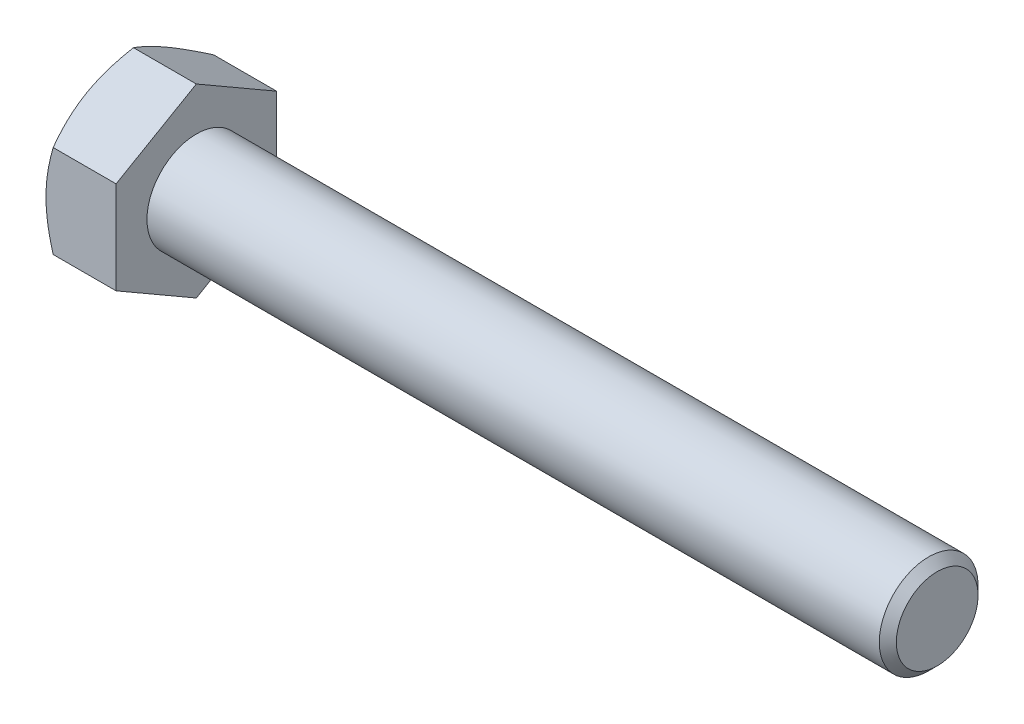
ISO-10303-21;
HEADER;
FILE_DESCRIPTION(('STEP AP214'),'2;1');
FILE_NAME('part.step','',(''),(''),'','','');
FILE_SCHEMA(('AUTOMOTIVE_DESIGN { 1 0 10303 214 1 1 1 1 }'));
ENDSEC;
DATA;
#1=APPLICATION_CONTEXT('core data for automotive mechanical design processes');
#2=APPLICATION_PROTOCOL_DEFINITION('international standard','automotive_design',2000,#1);
#3=PRODUCT_CONTEXT('',#1,'mechanical');
#4=PRODUCT('Part','Part','',(#3));
#5=PRODUCT_RELATED_PRODUCT_CATEGORY('part','',(#4));
#6=PRODUCT_DEFINITION_FORMATION('','',#4);
#7=PRODUCT_DEFINITION_CONTEXT('part definition',#1,'design');
#8=PRODUCT_DEFINITION('design','',#6,#7);
#9=PRODUCT_DEFINITION_SHAPE('','',#8);
#10=(LENGTH_UNIT() NAMED_UNIT(*) SI_UNIT(.MILLI.,.METRE.));
#11=(NAMED_UNIT(*) PLANE_ANGLE_UNIT() SI_UNIT($,.RADIAN.));
#12=(NAMED_UNIT(*) SI_UNIT($,.STERADIAN.) SOLID_ANGLE_UNIT());
#13=UNCERTAINTY_MEASURE_WITH_UNIT(LENGTH_MEASURE(1.E-05),#10,'distance_accuracy_value','');
#14=(GEOMETRIC_REPRESENTATION_CONTEXT(3) GLOBAL_UNCERTAINTY_ASSIGNED_CONTEXT((#13)) GLOBAL_UNIT_ASSIGNED_CONTEXT((#10,
#11,#12)) REPRESENTATION_CONTEXT('',''));
#15=CARTESIAN_POINT('',(0.,0.,0.));
#16=DIRECTION('',(0.,0.,1.));
#17=DIRECTION('',(1.,0.,0.));
#18=AXIS2_PLACEMENT_3D('',#15,#16,#17);
#19=CARTESIAN_POINT('',(5.675,3.75277674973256,-6.5));
#20=DIRECTION('',(0.,-0.866025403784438,0.500000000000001));
#21=DIRECTION('',(0.,-0.500000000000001,-0.866025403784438));
#22=AXIS2_PLACEMENT_3D('',#19,#20,#21);
#23=PLANE('',#22);
#24=CARTESIAN_POINT('',(0.580623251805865,7.50566896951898,0.0002));
#25=CARTESIAN_POINT('',(0.533004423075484,7.4231786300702,-0.14267745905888));
#26=CARTESIAN_POINT('',(0.487546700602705,7.34038072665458,-0.286087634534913));
#27=CARTESIAN_POINT('',(0.401548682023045,7.17411251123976,-0.574072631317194));
#28=CARTESIAN_POINT('',(0.361010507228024,7.09064192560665,-0.718647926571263));
#29=CARTESIAN_POINT('',(0.247571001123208,6.83889369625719,-1.15468865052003));
#30=CARTESIAN_POINT('',(0.183047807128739,6.66962231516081,-1.44787528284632));
#31=CARTESIAN_POINT('',(0.107386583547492,6.41631077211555,-1.88662374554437));
#32=CARTESIAN_POINT('',(0.0858328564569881,6.33302748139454,-2.03087463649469));
#33=CARTESIAN_POINT('',(0.0496903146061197,6.16608458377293,-2.32002821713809));
#34=CARTESIAN_POINT('',(0.0351008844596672,6.08242501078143,-2.46493084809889));
#35=CARTESIAN_POINT('',(0.0132587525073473,5.91496056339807,-2.75498777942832));
#36=CARTESIAN_POINT('',(0.00599772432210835,5.8311559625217,-2.90014160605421));
#37=CARTESIAN_POINT('',(-0.00103969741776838,5.66347396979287,-3.19057533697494));
#38=CARTESIAN_POINT('',(-0.000816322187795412,5.5795965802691,-3.33585523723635));
#39=CARTESIAN_POINT('',(0.0100834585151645,5.34979921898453,-3.73387594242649));
#40=CARTESIAN_POINT('',(0.0283818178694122,5.20395446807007,-3.98648646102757));
#41=CARTESIAN_POINT('',(0.0864063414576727,4.91323365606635,-4.49002967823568));
#42=CARTESIAN_POINT('',(0.126152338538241,4.76835861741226,-4.74096060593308));
#43=CARTESIAN_POINT('',(0.225505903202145,4.47705272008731,-5.24551722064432));
#44=CARTESIAN_POINT('',(0.285534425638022,4.33065861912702,-5.49907924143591));
#45=CARTESIAN_POINT('',(0.421774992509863,4.04005357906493,-6.00242193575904));
#46=CARTESIAN_POINT('',(0.497955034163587,3.89583891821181,-6.25220905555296));
#47=CARTESIAN_POINT('',(0.58062325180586,3.75266127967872,-6.5002));
#48=B_SPLINE_CURVE_WITH_KNOTS('',3,(#24,#25,#26,#27,#28,#29,#30,#31,#32,#33,#34,#35,#36,#37,#38,
#39,#40,#41,#42,#43,#44,#45,#46,#47),.UNSPECIFIED.,.F.,.F.,(4,2,2,2,2,2,2,2,2,2,2,4),(0.,
0.515105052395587,1.03043143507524,2.06322554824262,2.56697389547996,3.07067772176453,
3.57380860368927,4.0769239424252,4.9527935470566,5.82947446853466,6.72559912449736,
7.61996451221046),.UNSPECIFIED.);
#49=CARTESIAN_POINT('',(0.580556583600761,7.50555349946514,0.));
#50=VERTEX_POINT('',#49);
#51=CARTESIAN_POINT('',(0.,5.62916512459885,-3.25000000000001));
#52=VERTEX_POINT('',#51);
#53=EDGE_CURVE('E48',#50,#52,#48,.T.);
#54=ORIENTED_EDGE('',*,*,#53,.F.);
#55=DIRECTION('',(-1.,0.,0.));
#56=VECTOR('',#55,1.);
#57=CARTESIAN_POINT('',(5.675,7.50555349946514,0.));
#58=LINE('',#57,#56);
#59=CARTESIAN_POINT('',(5.675,7.50555349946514,0.));
#60=VERTEX_POINT('',#59);
#61=EDGE_CURVE('E144',#60,#50,#58,.T.);
#62=ORIENTED_EDGE('',*,*,#61,.F.);
#63=DIRECTION('',(0.,0.500000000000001,0.866025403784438));
#64=VECTOR('',#63,1.);
#65=CARTESIAN_POINT('',(5.675,3.75277674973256,-6.5));
#66=LINE('',#65,#64);
#67=CARTESIAN_POINT('',(5.675,3.75277674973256,-6.5));
#68=VERTEX_POINT('',#67);
#69=EDGE_CURVE('E229',#68,#60,#66,.T.);
#70=ORIENTED_EDGE('',*,*,#69,.F.);
#71=DIRECTION('',(-1.,0.,0.));
#72=VECTOR('',#71,1.);
#73=CARTESIAN_POINT('',(5.675,3.75277674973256,-6.5));
#74=LINE('',#73,#72);
#75=CARTESIAN_POINT('',(0.580556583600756,3.75277674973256,-6.5));
#76=VERTEX_POINT('',#75);
#77=EDGE_CURVE('E132',#68,#76,#74,.T.);
#78=ORIENTED_EDGE('',*,*,#77,.T.);
#79=EDGE_CURVE('E126',#52,#76,#48,.T.);
#80=ORIENTED_EDGE('',*,*,#79,.F.);
#81=EDGE_LOOP('',(#54,#62,#70,#78,#80));
#82=FACE_BOUND('',#81,.T.);
#83=ADVANCED_FACE('F32',(#82),#23,.F.);
#84=CARTESIAN_POINT('',(5.675,7.50555349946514,0.));
#85=DIRECTION('',(0.,-0.866025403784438,-0.500000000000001));
#86=DIRECTION('',(0.,0.500000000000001,-0.866025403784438));
#87=AXIS2_PLACEMENT_3D('',#84,#85,#86);
#88=PLANE('',#87);
#89=CARTESIAN_POINT('',(0.580623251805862,3.75266127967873,6.5002));
#90=CARTESIAN_POINT('',(0.53300442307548,3.8351516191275,6.35732254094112));
#91=CARTESIAN_POINT('',(0.487546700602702,3.91794952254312,6.21391236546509));
#92=CARTESIAN_POINT('',(0.401548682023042,4.08421773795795,5.9259273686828));
#93=CARTESIAN_POINT('',(0.361010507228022,4.16768832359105,5.78135207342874));
#94=CARTESIAN_POINT('',(0.247571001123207,4.41943655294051,5.34531134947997));
#95=CARTESIAN_POINT('',(0.183047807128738,4.58870793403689,5.05212471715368));
#96=CARTESIAN_POINT('',(0.107386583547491,4.84201947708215,4.61337625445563));
#97=CARTESIAN_POINT('',(0.0858328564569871,4.92530276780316,4.46912536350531));
#98=CARTESIAN_POINT('',(0.0496903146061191,5.09224566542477,4.17997178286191));
#99=CARTESIAN_POINT('',(0.0351008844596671,5.17590523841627,4.03506915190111));
#100=CARTESIAN_POINT('',(0.0132587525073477,5.34336968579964,3.74501222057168));
#101=CARTESIAN_POINT('',(0.00599772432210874,5.427174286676,3.59985839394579));
#102=CARTESIAN_POINT('',(-0.00103969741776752,5.59485627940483,3.30942466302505));
#103=CARTESIAN_POINT('',(-0.000816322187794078,5.6787336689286,3.16414476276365));
#104=CARTESIAN_POINT('',(0.0100834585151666,5.90853103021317,2.76612405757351));
#105=CARTESIAN_POINT('',(0.0283818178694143,6.05437578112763,2.51351353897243));
#106=CARTESIAN_POINT('',(0.0864063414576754,6.34509659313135,2.00997032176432));
#107=CARTESIAN_POINT('',(0.126152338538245,6.48997163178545,1.75903939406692));
#108=CARTESIAN_POINT('',(0.225505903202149,6.78127752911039,1.25448277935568));
#109=CARTESIAN_POINT('',(0.285534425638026,6.92767163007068,1.00092075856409));
#110=CARTESIAN_POINT('',(0.421774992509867,7.21827667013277,0.497578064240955));
#111=CARTESIAN_POINT('',(0.497955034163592,7.36249133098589,0.247790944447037));
#112=CARTESIAN_POINT('',(0.580623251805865,7.50566896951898,-0.000200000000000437));
#113=B_SPLINE_CURVE_WITH_KNOTS('',3,(#89,#90,#91,#92,#93,#94,#95,#96,#97,#98,#99,#100,#101,#102,
#103,#104,#105,#106,#107,#108,#109,#110,#111,#112),.UNSPECIFIED.,.F.,.F.,(4,2,2,2,2,2,2,2,2,2,2,
4),(0.,0.515105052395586,1.03043143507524,2.06322554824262,2.56697389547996,3.07067772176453,
3.57380860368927,4.07692394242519,4.9527935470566,5.82947446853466,6.72559912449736,
7.61996451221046),.UNSPECIFIED.);
#114=CARTESIAN_POINT('',(0.580556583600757,3.75277674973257,6.5));
#115=VERTEX_POINT('',#114);
#116=CARTESIAN_POINT('',(0.,5.62916512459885,3.25));
#117=VERTEX_POINT('',#116);
#118=EDGE_CURVE('E55',#115,#117,#113,.T.);
#119=ORIENTED_EDGE('',*,*,#118,.F.);
#120=DIRECTION('',(-1.,0.,0.));
#121=VECTOR('',#120,1.);
#122=CARTESIAN_POINT('',(5.675,3.75277674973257,6.5));
#123=LINE('',#122,#121);
#124=CARTESIAN_POINT('',(5.675,3.75277674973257,6.5));
#125=VERTEX_POINT('',#124);
#126=EDGE_CURVE('E142',#125,#115,#123,.T.);
#127=ORIENTED_EDGE('',*,*,#126,.F.);
#128=DIRECTION('',(0.,-0.500000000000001,0.866025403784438));
#129=VECTOR('',#128,1.);
#130=CARTESIAN_POINT('',(5.675,7.50555349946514,0.));
#131=LINE('',#130,#129);
#132=EDGE_CURVE('E227',#60,#125,#131,.T.);
#133=ORIENTED_EDGE('',*,*,#132,.F.);
#134=ORIENTED_EDGE('',*,*,#61,.T.);
#135=EDGE_CURVE('E159',#117,#50,#113,.T.);
#136=ORIENTED_EDGE('',*,*,#135,.F.);
#137=EDGE_LOOP('',(#119,#127,#133,#134,#136));
#138=FACE_BOUND('',#137,.T.);
#139=ADVANCED_FACE('F165',(#138),#88,.F.);
#140=CARTESIAN_POINT('',(5.675,3.75277674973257,6.5));
#141=DIRECTION('',(0.,0.,-1.));
#142=DIRECTION('',(0.,1.,0.));
#143=AXIS2_PLACEMENT_3D('',#140,#141,#142);
#144=PLANE('',#143);
#145=CARTESIAN_POINT('',(3.18835311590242,-10.1137456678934,6.5));
#146=CARTESIAN_POINT('',(3.05034774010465,-9.82952666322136,6.5));
#147=CARTESIAN_POINT('',(2.91365616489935,-9.54465869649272,6.5));
#148=CARTESIAN_POINT('',(2.64363899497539,-8.9732797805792,6.5));
#149=CARTESIAN_POINT('',(2.51031392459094,-8.6867685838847,6.5));
#150=CARTESIAN_POINT('',(2.24710473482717,-8.11029837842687,6.5));
#151=CARTESIAN_POINT('',(2.11724300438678,-7.8203291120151,6.5));
#152=CARTESIAN_POINT('',(1.86279082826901,-7.23809541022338,6.5));
#153=CARTESIAN_POINT('',(1.73820013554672,-6.94583108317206,6.5));
#154=CARTESIAN_POINT('',(1.4917668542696,-6.34906440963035,6.5));
#155=CARTESIAN_POINT('',(1.37014257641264,-6.04447142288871,6.5));
#156=CARTESIAN_POINT('',(1.13601865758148,-5.43173420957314,6.5));
#157=CARTESIAN_POINT('',(1.02352003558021,-5.12358959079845,6.5));
#158=CARTESIAN_POINT('',(0.810575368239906,-4.50382569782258,6.5));
#159=CARTESIAN_POINT('',(0.710105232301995,-4.19221478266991,6.5));
#160=CARTESIAN_POINT('',(0.524420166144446,-3.56452019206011,6.5));
#161=CARTESIAN_POINT('',(0.439200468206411,-3.24843794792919,6.5));
#162=CARTESIAN_POINT('',(0.288524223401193,-2.61335465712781,6.5));
#163=CARTESIAN_POINT('',(0.222961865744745,-2.29437912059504,6.5));
#164=CARTESIAN_POINT('',(0.115312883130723,-1.65238219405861,6.5));
#165=CARTESIAN_POINT('',(0.0732239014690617,-1.32936121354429,6.5));
#166=CARTESIAN_POINT('',(0.0304887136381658,-0.845231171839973,6.5));
#167=CARTESIAN_POINT('',(0.0196493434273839,-0.684982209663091,6.5));
#168=CARTESIAN_POINT('',(0.00475298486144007,-0.36416234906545,6.5));
#169=CARTESIAN_POINT('',(0.000695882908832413,-0.20359145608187,6.5));
#170=CARTESIAN_POINT('',(-0.00053159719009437,0.117577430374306,6.5));
#171=CARTESIAN_POINT('',(0.00229809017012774,0.278175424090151,6.5));
#172=CARTESIAN_POINT('',(0.014772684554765,0.599108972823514,6.5));
#173=CARTESIAN_POINT('',(0.0244179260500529,0.759444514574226,6.5));
#174=CARTESIAN_POINT('',(0.0554961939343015,1.14369946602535,6.5));
#175=CARTESIAN_POINT('',(0.0801030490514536,1.36736763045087,6.5));
#176=CARTESIAN_POINT('',(0.14124653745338,1.81305591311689,6.5));
#177=CARTESIAN_POINT('',(0.177784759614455,2.03507580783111,6.5));
#178=CARTESIAN_POINT('',(0.303360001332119,2.69839633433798,6.5));
#179=CARTESIAN_POINT('',(0.4083358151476,3.1367201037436,6.5));
#180=CARTESIAN_POINT('',(0.590564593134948,3.79232112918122,6.5));
#181=CARTESIAN_POINT('',(0.6563131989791,4.01299150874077,6.5));
#182=CARTESIAN_POINT('',(0.794681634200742,4.45218859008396,6.5));
#183=CARTESIAN_POINT('',(0.867301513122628,4.67071527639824,6.5));
#184=CARTESIAN_POINT('',(1.01824353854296,5.10569490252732,6.5));
#185=CARTESIAN_POINT('',(1.0965638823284,5.32214847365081,6.5));
#186=CARTESIAN_POINT('',(1.25798086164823,5.75325725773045,6.5));
#187=CARTESIAN_POINT('',(1.34107741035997,5.96791250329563,6.5));
#188=CARTESIAN_POINT('',(1.56029019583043,6.51888445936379,6.5));
#189=CARTESIAN_POINT('',(1.69936356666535,6.85402316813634,6.5));
#190=CARTESIAN_POINT('',(1.98501958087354,7.521095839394,6.5));
#191=CARTESIAN_POINT('',(2.13160288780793,7.85302951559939,6.5));
#192=CARTESIAN_POINT('',(2.43059748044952,8.51437865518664,6.5));
#193=CARTESIAN_POINT('',(2.5830105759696,8.843793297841,6.5));
#194=CARTESIAN_POINT('',(2.89234869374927,9.50047798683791,6.5));
#195=CARTESIAN_POINT('',(3.04927357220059,9.82774810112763,6.5));
#196=CARTESIAN_POINT('',(3.36692013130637,10.4809971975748,6.5));
#197=CARTESIAN_POINT('',(3.52764676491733,10.8069737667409,6.5));
#198=CARTESIAN_POINT('',(3.85198555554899,11.4574882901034,6.5));
#199=CARTESIAN_POINT('',(4.01559773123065,11.7820262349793,6.5));
#200=CARTESIAN_POINT('',(4.50986185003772,12.7537468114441,6.5));
#201=CARTESIAN_POINT('',(4.8439999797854,13.3991555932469,6.5));
#202=CARTESIAN_POINT('',(5.48575990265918,14.6239779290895,6.5));
#203=CARTESIAN_POINT('',(5.79279643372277,15.2036995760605,6.5));
#204=CARTESIAN_POINT('',(6.41069188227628,16.3611382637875,6.5));
#205=CARTESIAN_POINT('',(6.72155099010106,16.9388552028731,6.5));
#206=CARTESIAN_POINT('',(7.34519775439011,18.0910273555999,6.5));
#207=CARTESIAN_POINT('',(7.65797694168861,18.6654871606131,6.5));
#208=CARTESIAN_POINT('',(8.28574397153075,19.8131486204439,6.5));
#209=CARTESIAN_POINT('',(8.60073166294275,20.3863503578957,6.5));
#210=CARTESIAN_POINT('',(8.91652967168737,20.9591024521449,6.5));
#211=B_SPLINE_CURVE_WITH_KNOTS('',3,(#145,#146,#147,#148,#149,#150,#151,#152,#153,#154,#155,
#156,#157,#158,#159,#160,#161,#162,#163,#164,#165,#166,#167,#168,#169,#170,#171,#172,#173,#174,
#175,#176,#177,#178,#179,#180,#181,#182,#183,#184,#185,#186,#187,#188,#189,#190,#191,#192,#193,
#194,#195,#196,#197,#198,#199,#200,#201,#202,#203,#204,#205,#206,#207,#208,#209,#210),
.UNSPECIFIED.,.F.,.F.,(4,2,2,2,2,2,2,2,2,2,2,2,2,2,2,2,2,2,2,2,2,2,2,2,2,2,2,2,2,2,2,2,4),(0.,
0.94786866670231,1.89588406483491,2.84900320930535,3.80207763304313,4.78589774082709,
5.76982755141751,6.75175256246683,7.73337005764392,8.7096047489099,9.68574140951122,
10.1674651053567,10.6491807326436,11.1309009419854,11.6126447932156,12.287317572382,
12.9620802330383,14.312318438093,15.0030310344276,15.6937486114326,16.3842486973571,
17.0747362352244,18.1631508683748,19.2516618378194,20.3405135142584,21.429330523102,
22.5196540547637,23.6099846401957,25.7902468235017,27.7582608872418,29.7263733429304,
31.6886408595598,33.6507753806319),.UNSPECIFIED.);
#212=CARTESIAN_POINT('',(0.580556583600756,-3.75277674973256,6.5));
#213=VERTEX_POINT('',#212);
#214=CARTESIAN_POINT('',(0.,0.,6.5));
#215=VERTEX_POINT('',#214);
#216=EDGE_CURVE('E239',#213,#215,#211,.T.);
#217=ORIENTED_EDGE('',*,*,#216,.F.);
#218=DIRECTION('',(-1.,0.,0.));
#219=VECTOR('',#218,1.);
#220=CARTESIAN_POINT('',(5.675,-3.75277674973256,6.5));
#221=LINE('',#220,#219);
#222=CARTESIAN_POINT('',(5.675,-3.75277674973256,6.5));
#223=VERTEX_POINT('',#222);
#224=EDGE_CURVE('E134',#223,#213,#221,.T.);
#225=ORIENTED_EDGE('',*,*,#224,.F.);
#226=DIRECTION('',(0.,-1.,0.));
#227=VECTOR('',#226,1.);
#228=CARTESIAN_POINT('',(5.675,3.75277674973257,6.5));
#229=LINE('',#228,#227);
#230=EDGE_CURVE('E223',#125,#223,#229,.T.);
#231=ORIENTED_EDGE('',*,*,#230,.F.);
#232=ORIENTED_EDGE('',*,*,#126,.T.);
#233=EDGE_CURVE('E181',#215,#115,#211,.T.);
#234=ORIENTED_EDGE('',*,*,#233,.F.);
#235=EDGE_LOOP('',(#217,#225,#231,#232,#234));
#236=FACE_BOUND('',#235,.T.);
#237=ADVANCED_FACE('F245',(#236),#144,.F.);
#238=CARTESIAN_POINT('',(5.675,-7.50555349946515,0.));
#239=DIRECTION('',(0.,0.866025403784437,-0.500000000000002));
#240=DIRECTION('',(0.,0.500000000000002,0.866025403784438));
#241=AXIS2_PLACEMENT_3D('',#238,#239,#240);
#242=PLANE('',#241);
#243=CARTESIAN_POINT('',(0.580623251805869,-7.50566896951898,-0.000200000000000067));
#244=CARTESIAN_POINT('',(0.533004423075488,-7.42317863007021,0.14267745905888));
#245=CARTESIAN_POINT('',(0.487546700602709,-7.34038072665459,0.286087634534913));
#246=CARTESIAN_POINT('',(0.401548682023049,-7.17411251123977,0.574072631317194));
#247=CARTESIAN_POINT('',(0.361010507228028,-7.09064192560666,0.718647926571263));
#248=CARTESIAN_POINT('',(0.247571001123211,-6.8388936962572,1.15468865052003));
#249=CARTESIAN_POINT('',(0.183047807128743,-6.66962231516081,1.44787528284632));
#250=CARTESIAN_POINT('',(0.107386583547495,-6.41631077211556,1.88662374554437));
#251=CARTESIAN_POINT('',(0.0858328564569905,-6.33302748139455,2.03087463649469));
#252=CARTESIAN_POINT('',(0.049690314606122,-6.16608458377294,2.32002821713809));
#253=CARTESIAN_POINT('',(0.0351008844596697,-6.08242501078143,2.46493084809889));
#254=CARTESIAN_POINT('',(0.0132587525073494,-5.91496056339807,2.75498777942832));
#255=CARTESIAN_POINT('',(0.00599772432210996,-5.83115596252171,2.90014160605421));
#256=CARTESIAN_POINT('',(-0.00103969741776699,-5.66347396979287,3.19057533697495));
#257=CARTESIAN_POINT('',(-0.000816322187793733,-5.5795965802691,3.33585523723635));
#258=CARTESIAN_POINT('',(0.0100834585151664,-5.34979921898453,3.73387594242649));
#259=CARTESIAN_POINT('',(0.0283818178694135,-5.20395446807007,3.98648646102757));
#260=CARTESIAN_POINT('',(0.0864063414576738,-4.91323365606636,4.49002967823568));
#261=CARTESIAN_POINT('',(0.126152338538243,-4.76835861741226,4.74096060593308));
#262=CARTESIAN_POINT('',(0.225505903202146,-4.47705272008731,5.24551722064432));
#263=CARTESIAN_POINT('',(0.285534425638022,-4.33065861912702,5.49907924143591));
#264=CARTESIAN_POINT('',(0.421774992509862,-4.04005357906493,6.00242193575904));
#265=CARTESIAN_POINT('',(0.497955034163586,-3.89583891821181,6.25220905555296));
#266=CARTESIAN_POINT('',(0.580623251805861,-3.75266127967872,6.5002));
#267=B_SPLINE_CURVE_WITH_KNOTS('',3,(#243,#244,#245,#246,#247,#248,#249,#250,#251,#252,#253,
#254,#255,#256,#257,#258,#259,#260,#261,#262,#263,#264,#265,#266),.UNSPECIFIED.,.F.,.F.,(4,2,2,
2,2,2,2,2,2,2,2,4),(0.,0.515105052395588,1.03043143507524,2.06322554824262,2.56697389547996,
3.07067772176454,3.57380860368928,4.0769239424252,4.9527935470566,5.82947446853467,
6.72559912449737,7.61996451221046),.UNSPECIFIED.);
#268=CARTESIAN_POINT('',(0.580556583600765,-7.50555349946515,0.));
#269=VERTEX_POINT('',#268);
#270=CARTESIAN_POINT('',(0.,-5.62916512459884,3.25000000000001));
#271=VERTEX_POINT('',#270);
#272=EDGE_CURVE('E167',#269,#271,#267,.T.);
#273=ORIENTED_EDGE('',*,*,#272,.F.);
#274=DIRECTION('',(-1.,0.,0.));
#275=VECTOR('',#274,1.);
#276=CARTESIAN_POINT('',(5.675,-7.50555349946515,0.));
#277=LINE('',#276,#275);
#278=CARTESIAN_POINT('',(5.675,-7.50555349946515,0.));
#279=VERTEX_POINT('',#278);
#280=EDGE_CURVE('E131',#279,#269,#277,.T.);
#281=ORIENTED_EDGE('',*,*,#280,.F.);
#282=DIRECTION('',(0.,-0.500000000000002,-0.866025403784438));
#283=VECTOR('',#282,1.);
#284=CARTESIAN_POINT('',(5.675,-7.50555349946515,0.));
#285=LINE('',#284,#283);
#286=EDGE_CURVE('E221',#223,#279,#285,.T.);
#287=ORIENTED_EDGE('',*,*,#286,.F.);
#288=ORIENTED_EDGE('',*,*,#224,.T.);
#289=EDGE_CURVE('E169',#271,#213,#267,.T.);
#290=ORIENTED_EDGE('',*,*,#289,.F.);
#291=EDGE_LOOP('',(#273,#281,#287,#288,#290));
#292=FACE_BOUND('',#291,.T.);
#293=ADVANCED_FACE('F217',(#292),#242,.F.);
#294=CARTESIAN_POINT('',(5.675,-3.75277674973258,-6.5));
#295=DIRECTION('',(0.,0.866025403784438,0.5));
#296=DIRECTION('',(0.,-0.5,0.866025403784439));
#297=AXIS2_PLACEMENT_3D('',#294,#295,#296);
#298=PLANE('',#297);
#299=CARTESIAN_POINT('',(0.580623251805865,-3.75266127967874,-6.5002));
#300=CARTESIAN_POINT('',(0.533004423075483,-3.83515161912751,-6.35732254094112));
#301=CARTESIAN_POINT('',(0.487546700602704,-3.91794952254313,-6.21391236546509));
#302=CARTESIAN_POINT('',(0.401548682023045,-4.08421773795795,-5.9259273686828));
#303=CARTESIAN_POINT('',(0.361010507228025,-4.16768832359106,-5.78135207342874));
#304=CARTESIAN_POINT('',(0.24757100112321,-4.41943655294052,-5.34531134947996));
#305=CARTESIAN_POINT('',(0.183047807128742,-4.5887079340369,-5.05212471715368));
#306=CARTESIAN_POINT('',(0.107386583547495,-4.84201947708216,-4.61337625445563));
#307=CARTESIAN_POINT('',(0.085832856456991,-4.92530276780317,-4.46912536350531));
#308=CARTESIAN_POINT('',(0.0496903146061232,-5.09224566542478,-4.17997178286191));
#309=CARTESIAN_POINT('',(0.0351008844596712,-5.17590523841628,-4.03506915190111));
#310=CARTESIAN_POINT('',(0.0132587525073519,-5.34336968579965,-3.74501222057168));
#311=CARTESIAN_POINT('',(0.00599772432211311,-5.42717428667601,-3.59985839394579));
#312=CARTESIAN_POINT('',(-0.00103969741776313,-5.59485627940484,-3.30942466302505));
#313=CARTESIAN_POINT('',(-0.000816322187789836,-5.67873366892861,-3.16414476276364));
#314=CARTESIAN_POINT('',(0.0100834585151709,-5.90853103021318,-2.76612405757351));
#315=CARTESIAN_POINT('',(0.028381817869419,-6.05437578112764,-2.51351353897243));
#316=CARTESIAN_POINT('',(0.0864063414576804,-6.34509659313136,-2.00997032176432));
#317=CARTESIAN_POINT('',(0.12615233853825,-6.48997163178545,-1.75903939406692));
#318=CARTESIAN_POINT('',(0.225505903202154,-6.78127752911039,-1.25448277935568));
#319=CARTESIAN_POINT('',(0.28553442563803,-6.92767163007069,-1.00092075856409));
#320=CARTESIAN_POINT('',(0.421774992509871,-7.21827667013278,-0.497578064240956));
#321=CARTESIAN_POINT('',(0.497955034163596,-7.3624913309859,-0.247790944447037));
#322=CARTESIAN_POINT('',(0.580623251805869,-7.50566896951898,0.000199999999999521));
#323=B_SPLINE_CURVE_WITH_KNOTS('',3,(#299,#300,#301,#302,#303,#304,#305,#306,#307,#308,#309,
#310,#311,#312,#313,#314,#315,#316,#317,#318,#319,#320,#321,#322),.UNSPECIFIED.,.F.,.F.,(4,2,2,
2,2,2,2,2,2,2,2,4),(0.,0.515105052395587,1.03043143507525,2.06322554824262,2.56697389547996,
3.07067772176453,3.57380860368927,4.0769239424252,4.9527935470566,5.82947446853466,
6.72559912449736,7.61996451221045),.UNSPECIFIED.);
#324=CARTESIAN_POINT('',(0.580556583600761,-3.75277674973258,-6.5));
#325=VERTEX_POINT('',#324);
#326=CARTESIAN_POINT('',(0.,-5.62916512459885,-3.25));
#327=VERTEX_POINT('',#326);
#328=EDGE_CURVE('E108',#325,#327,#323,.T.);
#329=ORIENTED_EDGE('',*,*,#328,.F.);
#330=DIRECTION('',(-1.,0.,0.));
#331=VECTOR('',#330,1.);
#332=CARTESIAN_POINT('',(5.675,-3.75277674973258,-6.5));
#333=LINE('',#332,#331);
#334=CARTESIAN_POINT('',(5.675,-3.75277674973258,-6.5));
#335=VERTEX_POINT('',#334);
#336=EDGE_CURVE('E122',#335,#325,#333,.T.);
#337=ORIENTED_EDGE('',*,*,#336,.F.);
#338=DIRECTION('',(0.,0.5,-0.866025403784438));
#339=VECTOR('',#338,1.);
#340=CARTESIAN_POINT('',(5.675,-3.75277674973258,-6.5));
#341=LINE('',#340,#339);
#342=EDGE_CURVE('E219',#279,#335,#341,.T.);
#343=ORIENTED_EDGE('',*,*,#342,.F.);
#344=ORIENTED_EDGE('',*,*,#280,.T.);
#345=EDGE_CURVE('E125',#327,#269,#323,.T.);
#346=ORIENTED_EDGE('',*,*,#345,.F.);
#347=EDGE_LOOP('',(#329,#337,#343,#344,#346));
#348=FACE_BOUND('',#347,.T.);
#349=ADVANCED_FACE('F120',(#348),#298,.F.);
#350=CARTESIAN_POINT('',(5.675,3.75277674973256,-6.5));
#351=DIRECTION('',(0.,0.,1.));
#352=DIRECTION('',(0.,-1.,0.));
#353=AXIS2_PLACEMENT_3D('',#350,#351,#352);
#354=PLANE('',#353);
#355=CARTESIAN_POINT('',(3.18835311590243,-10.1137456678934,-6.5));
#356=CARTESIAN_POINT('',(3.05034774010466,-9.82952666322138,-6.5));
#357=CARTESIAN_POINT('',(2.91365616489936,-9.54465869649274,-6.5));
#358=CARTESIAN_POINT('',(2.64363899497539,-8.97327978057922,-6.5));
#359=CARTESIAN_POINT('',(2.51031392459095,-8.68676858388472,-6.5));
#360=CARTESIAN_POINT('',(2.24710473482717,-8.11029837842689,-6.5));
#361=CARTESIAN_POINT('',(2.11724300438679,-7.82032911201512,-6.5));
#362=CARTESIAN_POINT('',(1.86279082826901,-7.2380954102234,-6.5));
#363=CARTESIAN_POINT('',(1.73820013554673,-6.94583108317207,-6.5));
#364=CARTESIAN_POINT('',(1.4917668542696,-6.34906440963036,-6.5));
#365=CARTESIAN_POINT('',(1.37014257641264,-6.04447142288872,-6.5));
#366=CARTESIAN_POINT('',(1.13601865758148,-5.43173420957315,-6.5));
#367=CARTESIAN_POINT('',(1.02352003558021,-5.12358959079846,-6.5));
#368=CARTESIAN_POINT('',(0.810575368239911,-4.5038256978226,-6.5));
#369=CARTESIAN_POINT('',(0.710105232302,-4.19221478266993,-6.5));
#370=CARTESIAN_POINT('',(0.52442016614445,-3.56452019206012,-6.5));
#371=CARTESIAN_POINT('',(0.439200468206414,-3.24843794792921,-6.5));
#372=CARTESIAN_POINT('',(0.288524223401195,-2.61335465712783,-6.5));
#373=CARTESIAN_POINT('',(0.222961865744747,-2.29437912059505,-6.5));
#374=CARTESIAN_POINT('',(0.115312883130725,-1.65238219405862,-6.5));
#375=CARTESIAN_POINT('',(0.0732239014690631,-1.3293612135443,-6.5));
#376=CARTESIAN_POINT('',(0.0304887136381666,-0.845231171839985,-6.5));
#377=CARTESIAN_POINT('',(0.0196493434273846,-0.684982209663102,-6.5));
#378=CARTESIAN_POINT('',(0.00475298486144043,-0.36416234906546,-6.5));
#379=CARTESIAN_POINT('',(0.000695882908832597,-0.20359145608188,-6.5));
#380=CARTESIAN_POINT('',(-0.000531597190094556,0.117577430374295,-6.5));
#381=CARTESIAN_POINT('',(0.00229809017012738,0.278175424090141,-6.5));
#382=CARTESIAN_POINT('',(0.0147726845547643,0.599108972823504,-6.5));
#383=CARTESIAN_POINT('',(0.0244179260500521,0.759444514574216,-6.5));
#384=CARTESIAN_POINT('',(0.0554961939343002,1.14369946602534,-6.5));
#385=CARTESIAN_POINT('',(0.0801030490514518,1.36736763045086,-6.5));
#386=CARTESIAN_POINT('',(0.141246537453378,1.81305591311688,-6.5));
#387=CARTESIAN_POINT('',(0.177784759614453,2.03507580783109,-6.5));
#388=CARTESIAN_POINT('',(0.303360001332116,2.69839633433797,-6.5));
#389=CARTESIAN_POINT('',(0.408335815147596,3.13672010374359,-6.5));
#390=CARTESIAN_POINT('',(0.590564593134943,3.79232112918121,-6.5));
#391=CARTESIAN_POINT('',(0.656313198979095,4.01299150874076,-6.5));
#392=CARTESIAN_POINT('',(0.794681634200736,4.45218859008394,-6.5));
#393=CARTESIAN_POINT('',(0.867301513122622,4.67071527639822,-6.5));
#394=CARTESIAN_POINT('',(1.01824353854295,5.1056949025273,-6.5));
#395=CARTESIAN_POINT('',(1.09656388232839,5.3221484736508,-6.5));
#396=CARTESIAN_POINT('',(1.25798086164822,5.75325725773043,-6.5));
#397=CARTESIAN_POINT('',(1.34107741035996,5.96791250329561,-6.5));
#398=CARTESIAN_POINT('',(1.56029019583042,6.51888445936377,-6.5));
#399=CARTESIAN_POINT('',(1.69936356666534,6.85402316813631,-6.5));
#400=CARTESIAN_POINT('',(1.98501958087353,7.52109583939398,-6.5));
#401=CARTESIAN_POINT('',(2.13160288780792,7.85302951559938,-6.5));
#402=CARTESIAN_POINT('',(2.43059748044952,8.51437865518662,-6.5));
#403=CARTESIAN_POINT('',(2.58301057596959,8.84379329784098,-6.5));
#404=CARTESIAN_POINT('',(2.89234869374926,9.50047798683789,-6.5));
#405=CARTESIAN_POINT('',(3.04927357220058,9.82774810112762,-6.5));
#406=CARTESIAN_POINT('',(3.36692013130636,10.4809971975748,-6.5));
#407=CARTESIAN_POINT('',(3.52764676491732,10.8069737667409,-6.5));
#408=CARTESIAN_POINT('',(3.85198555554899,11.4574882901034,-6.5));
#409=CARTESIAN_POINT('',(4.01559773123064,11.7820262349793,-6.5));
#410=CARTESIAN_POINT('',(4.50986185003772,12.7537468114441,-6.5));
#411=CARTESIAN_POINT('',(4.84399997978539,13.3991555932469,-6.5));
#412=CARTESIAN_POINT('',(5.48575990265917,14.6239779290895,-6.5));
#413=CARTESIAN_POINT('',(5.79279643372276,15.2036995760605,-6.5));
#414=CARTESIAN_POINT('',(6.41069188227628,16.3611382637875,-6.5));
#415=CARTESIAN_POINT('',(6.72155099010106,16.9388552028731,-6.5));
#416=CARTESIAN_POINT('',(7.34519775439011,18.0910273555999,-6.5));
#417=CARTESIAN_POINT('',(7.65797694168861,18.6654871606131,-6.5));
#418=CARTESIAN_POINT('',(8.28574397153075,19.8131486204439,-6.5));
#419=CARTESIAN_POINT('',(8.60073166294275,20.3863503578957,-6.5));
#420=CARTESIAN_POINT('',(8.91652967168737,20.9591024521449,-6.5));
#421=B_SPLINE_CURVE_WITH_KNOTS('',3,(#355,#356,#357,#358,#359,#360,#361,#362,#363,#364,#365,
#366,#367,#368,#369,#370,#371,#372,#373,#374,#375,#376,#377,#378,#379,#380,#381,#382,#383,#384,
#385,#386,#387,#388,#389,#390,#391,#392,#393,#394,#395,#396,#397,#398,#399,#400,#401,#402,#403,
#404,#405,#406,#407,#408,#409,#410,#411,#412,#413,#414,#415,#416,#417,#418,#419,#420),
.UNSPECIFIED.,.F.,.F.,(4,2,2,2,2,2,2,2,2,2,2,2,2,2,2,2,2,2,2,2,2,2,2,2,2,2,2,2,2,2,2,2,4),(0.,
0.947868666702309,1.89588406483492,2.84900320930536,3.80207763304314,4.7858977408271,
5.76982755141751,6.75175256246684,7.73337005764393,8.7096047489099,9.68574140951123,
10.1674651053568,10.6491807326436,11.1309009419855,11.6126447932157,12.287317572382,
12.9620802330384,14.312318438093,15.0030310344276,15.6937486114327,16.3842486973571,
17.0747362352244,18.1631508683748,19.2516618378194,20.3405135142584,21.429330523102,
22.5196540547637,23.6099846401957,25.7902468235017,27.7582608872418,29.7263733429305,
31.6886408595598,33.6507753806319),.UNSPECIFIED.);
#422=CARTESIAN_POINT('',(0.,0.,-6.5));
#423=VERTEX_POINT('',#422);
#424=EDGE_CURVE('E114',#76,#423,#421,.F.);
#425=ORIENTED_EDGE('',*,*,#424,.F.);
#426=ORIENTED_EDGE('',*,*,#77,.F.);
#427=DIRECTION('',(0.,1.,0.));
#428=VECTOR('',#427,1.);
#429=CARTESIAN_POINT('',(5.675,3.75277674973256,-6.5));
#430=LINE('',#429,#428);
#431=EDGE_CURVE('E130',#335,#68,#430,.T.);
#432=ORIENTED_EDGE('',*,*,#431,.F.);
#433=ORIENTED_EDGE('',*,*,#336,.T.);
#434=EDGE_CURVE('E105',#423,#325,#421,.F.);
#435=ORIENTED_EDGE('',*,*,#434,.F.);
#436=EDGE_LOOP('',(#425,#426,#432,#433,#435));
#437=FACE_BOUND('',#436,.T.);
#438=ADVANCED_FACE('F128',(#437),#354,.F.);
#439=CARTESIAN_POINT('',(5.675,7.50555349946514,0.));
#440=DIRECTION('',(1.,0.,0.));
#441=DIRECTION('',(0.,0.,-1.));
#442=AXIS2_PLACEMENT_3D('',#439,#440,#441);
#443=PLANE('',#442);
#444=ORIENTED_EDGE('',*,*,#69,.T.);
#445=ORIENTED_EDGE('',*,*,#132,.T.);
#446=ORIENTED_EDGE('',*,*,#230,.T.);
#447=ORIENTED_EDGE('',*,*,#286,.T.);
#448=ORIENTED_EDGE('',*,*,#342,.T.);
#449=ORIENTED_EDGE('',*,*,#431,.T.);
#450=EDGE_LOOP('',(#444,#445,#446,#447,#448,#449));
#451=FACE_BOUND('',#450,.T.);
#452=CARTESIAN_POINT('',(5.675,0.,0.));
#453=DIRECTION('',(1.,0.,0.));
#454=DIRECTION('',(0.,0.,-1.));
#455=AXIS2_PLACEMENT_3D('',#452,#453,#454);
#456=CIRCLE('',#455,4.);
#457=CARTESIAN_POINT('',(5.675,0.,-4.));
#458=VERTEX_POINT('',#457);
#459=EDGE_CURVE('E232',#458,#458,#456,.F.);
#460=ORIENTED_EDGE('',*,*,#459,.T.);
#461=EDGE_LOOP('',(#460));
#462=FACE_BOUND('',#461,.T.);
#463=ADVANCED_FACE('F247',(#451,#462),#443,.T.);
#464=CARTESIAN_POINT('',(0.,0.,0.));
#465=DIRECTION('',(-1.,0.,0.));
#466=DIRECTION('',(0.,0.,1.));
#467=AXIS2_PLACEMENT_3D('',#464,#465,#466);
#468=CYLINDRICAL_SURFACE('',#467,4.);
#469=ORIENTED_EDGE('',*,*,#459,.F.);
#470=EDGE_LOOP('',(#469));
#471=FACE_BOUND('',#470,.T.);
#472=CARTESIAN_POINT('',(64.9845,0.,0.));
#473=DIRECTION('',(-1.,0.,0.));
#474=DIRECTION('',(0.,0.,1.));
#475=AXIS2_PLACEMENT_3D('',#472,#473,#474);
#476=CIRCLE('',#475,4.);
#477=CARTESIAN_POINT('',(64.9845,0.,4.));
#478=VERTEX_POINT('',#477);
#479=EDGE_CURVE('E235',#478,#478,#476,.T.);
#480=ORIENTED_EDGE('',*,*,#479,.T.);
#481=EDGE_LOOP('',(#480));
#482=FACE_BOUND('',#481,.T.);
#483=ADVANCED_FACE('F279',(#471,#482),#468,.T.);
#484=CARTESIAN_POINT('',(65.675,0.,0.));
#485=DIRECTION('',(-1.,0.,0.));
#486=DIRECTION('',(0.,0.,1.));
#487=AXIS2_PLACEMENT_3D('',#484,#485,#486);
#488=CONICAL_SURFACE('',#487,3.3095,0.785398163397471);
#489=ORIENTED_EDGE('',*,*,#479,.F.);
#490=EDGE_LOOP('',(#489));
#491=FACE_BOUND('',#490,.T.);
#492=CARTESIAN_POINT('',(65.675,0.,0.));
#493=DIRECTION('',(-1.,0.,0.));
#494=DIRECTION('',(0.,0.,1.));
#495=AXIS2_PLACEMENT_3D('',#492,#493,#494);
#496=CIRCLE('',#495,3.3095);
#497=CARTESIAN_POINT('',(65.675,0.,3.3095));
#498=VERTEX_POINT('',#497);
#499=EDGE_CURVE('E237',#498,#498,#496,.T.);
#500=ORIENTED_EDGE('',*,*,#499,.T.);
#501=EDGE_LOOP('',(#500));
#502=FACE_BOUND('',#501,.T.);
#503=ADVANCED_FACE('F281',(#491,#502),#488,.T.);
#504=CARTESIAN_POINT('',(65.675,0.,0.));
#505=DIRECTION('',(-1.,0.,0.));
#506=DIRECTION('',(0.,0.,1.));
#507=AXIS2_PLACEMENT_3D('',#504,#505,#506);
#508=PLANE('',#507);
#509=ORIENTED_EDGE('',*,*,#499,.F.);
#510=EDGE_LOOP('',(#509));
#511=FACE_BOUND('',#510,.T.);
#512=ADVANCED_FACE('F194',(#511),#508,.F.);
#513=CARTESIAN_POINT('',(0.,0.,0.));
#514=DIRECTION('',(1.,0.,0.));
#515=DIRECTION('',(0.,0.,-1.));
#516=AXIS2_PLACEMENT_3D('',#513,#514,#515);
#517=CONICAL_SURFACE('',#516,6.5,1.0471975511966);
#518=ORIENTED_EDGE('',*,*,#328,.T.);
#519=CARTESIAN_POINT('',(0.,0.,0.));
#520=DIRECTION('',(1.,0.,0.));
#521=DIRECTION('',(0.,0.,-1.));
#522=AXIS2_PLACEMENT_3D('',#519,#520,#521);
#523=CIRCLE('',#522,6.5);
#524=EDGE_CURVE('E36',#327,#423,#523,.T.);
#525=ORIENTED_EDGE('',*,*,#524,.T.);
#526=ORIENTED_EDGE('',*,*,#434,.T.);
#527=EDGE_LOOP('',(#518,#525,#526));
#528=FACE_BOUND('',#527,.T.);
#529=ADVANCED_FACE('F107',(#528),#517,.T.);
#530=ORIENTED_EDGE('',*,*,#272,.T.);
#531=EDGE_CURVE('E149',#271,#327,#523,.T.);
#532=ORIENTED_EDGE('',*,*,#531,.T.);
#533=ORIENTED_EDGE('',*,*,#345,.T.);
#534=EDGE_LOOP('',(#530,#532,#533));
#535=FACE_BOUND('',#534,.T.);
#536=ADVANCED_FACE('F193',(#535),#517,.T.);
#537=ORIENTED_EDGE('',*,*,#216,.T.);
#538=EDGE_CURVE('E150',#215,#271,#523,.T.);
#539=ORIENTED_EDGE('',*,*,#538,.T.);
#540=ORIENTED_EDGE('',*,*,#289,.T.);
#541=EDGE_LOOP('',(#537,#539,#540));
#542=FACE_BOUND('',#541,.T.);
#543=ADVANCED_FACE('F188',(#542),#517,.T.);
#544=ORIENTED_EDGE('',*,*,#233,.T.);
#545=ORIENTED_EDGE('',*,*,#118,.T.);
#546=CARTESIAN_POINT('',(0.,0.,0.));
#547=DIRECTION('',(-1.,0.,0.));
#548=DIRECTION('',(0.,0.,1.));
#549=AXIS2_PLACEMENT_3D('',#546,#547,#548);
#550=CIRCLE('',#549,6.5);
#551=EDGE_CURVE('E115',#215,#117,#550,.T.);
#552=ORIENTED_EDGE('',*,*,#551,.F.);
#553=EDGE_LOOP('',(#544,#545,#552));
#554=FACE_BOUND('',#553,.T.);
#555=ADVANCED_FACE('F192',(#554),#517,.T.);
#556=ORIENTED_EDGE('',*,*,#135,.T.);
#557=ORIENTED_EDGE('',*,*,#53,.T.);
#558=EDGE_CURVE('E41',#52,#117,#523,.T.);
#559=ORIENTED_EDGE('',*,*,#558,.T.);
#560=EDGE_LOOP('',(#556,#557,#559));
#561=FACE_BOUND('',#560,.T.);
#562=ADVANCED_FACE('F158',(#561),#517,.T.);
#563=ORIENTED_EDGE('',*,*,#79,.T.);
#564=ORIENTED_EDGE('',*,*,#424,.T.);
#565=EDGE_CURVE('E11',#423,#52,#523,.T.);
#566=ORIENTED_EDGE('',*,*,#565,.T.);
#567=EDGE_LOOP('',(#563,#564,#566));
#568=FACE_BOUND('',#567,.T.);
#569=ADVANCED_FACE('F251',(#568),#517,.T.);
#570=CARTESIAN_POINT('',(0.,7.50555349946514,0.));
#571=DIRECTION('',(1.,0.,0.));
#572=DIRECTION('',(0.,0.,-1.));
#573=AXIS2_PLACEMENT_3D('',#570,#571,#572);
#574=PLANE('',#573);
#575=ORIENTED_EDGE('',*,*,#565,.F.);
#576=ORIENTED_EDGE('',*,*,#524,.F.);
#577=ORIENTED_EDGE('',*,*,#531,.F.);
#578=ORIENTED_EDGE('',*,*,#538,.F.);
#579=ORIENTED_EDGE('',*,*,#551,.T.);
#580=ORIENTED_EDGE('',*,*,#558,.F.);
#581=EDGE_LOOP('',(#575,#576,#577,#578,#579,#580));
#582=FACE_BOUND('',#581,.T.);
#583=ADVANCED_FACE('F162',(#582),#574,.F.);
#584=CLOSED_SHELL('',(#83,#139,#237,#293,#349,#438,#463,#483,#503,#512,#529,#536,#543,#555,#562,
#569,#583));
#585=MANIFOLD_SOLID_BREP('B2',#584);
#586=ADVANCED_BREP_SHAPE_REPRESENTATION('',(#18,#585),#14);
#587=SHAPE_DEFINITION_REPRESENTATION(#9,#586);
ENDSEC;
END-ISO-10303-21;
